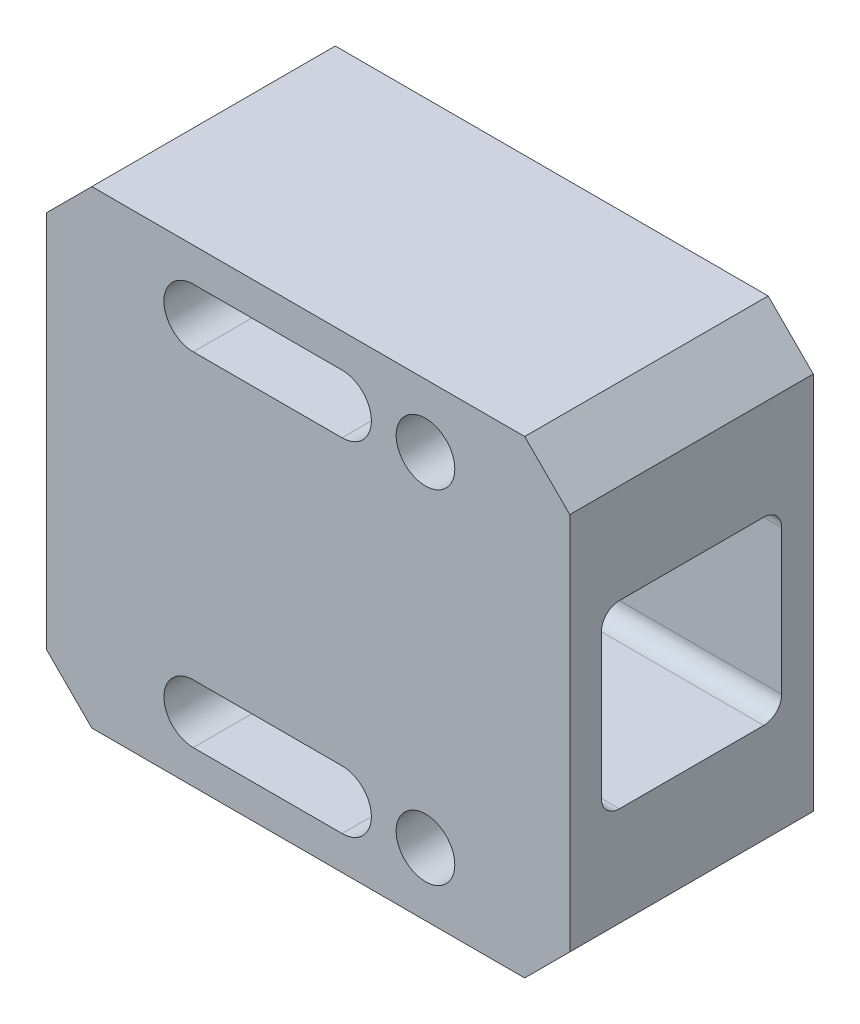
ISO-10303-21;
HEADER;
FILE_DESCRIPTION(('STEP AP214'),'2;1');
FILE_NAME('part.step','',(''),(''),'','','');
FILE_SCHEMA(('AUTOMOTIVE_DESIGN { 1 0 10303 214 1 1 1 1 }'));
ENDSEC;
DATA;
#1=APPLICATION_CONTEXT('core data for automotive mechanical design processes');
#2=APPLICATION_PROTOCOL_DEFINITION('international standard','automotive_design',2000,#1);
#3=PRODUCT_CONTEXT('',#1,'mechanical');
#4=PRODUCT('Part','Part','',(#3));
#5=PRODUCT_RELATED_PRODUCT_CATEGORY('part','',(#4));
#6=PRODUCT_DEFINITION_FORMATION('','',#4);
#7=PRODUCT_DEFINITION_CONTEXT('part definition',#1,'design');
#8=PRODUCT_DEFINITION('design','',#6,#7);
#9=PRODUCT_DEFINITION_SHAPE('','',#8);
#10=(LENGTH_UNIT() NAMED_UNIT(*) SI_UNIT(.MILLI.,.METRE.));
#11=(NAMED_UNIT(*) PLANE_ANGLE_UNIT() SI_UNIT($,.RADIAN.));
#12=(NAMED_UNIT(*) SI_UNIT($,.STERADIAN.) SOLID_ANGLE_UNIT());
#13=UNCERTAINTY_MEASURE_WITH_UNIT(LENGTH_MEASURE(1.E-05),#10,'distance_accuracy_value','');
#14=(GEOMETRIC_REPRESENTATION_CONTEXT(3) GLOBAL_UNCERTAINTY_ASSIGNED_CONTEXT((#13)) GLOBAL_UNIT_ASSIGNED_CONTEXT((#10,
#11,#12)) REPRESENTATION_CONTEXT('',''));
#15=CARTESIAN_POINT('',(0.,0.,0.));
#16=DIRECTION('',(0.,0.,1.));
#17=DIRECTION('',(1.,0.,0.));
#18=AXIS2_PLACEMENT_3D('',#15,#16,#17);
#19=CARTESIAN_POINT('',(-22.25,19.,13.5));
#20=DIRECTION('',(1.,0.,0.));
#21=DIRECTION('',(0.,1.,0.));
#22=AXIS2_PLACEMENT_3D('',#19,#20,#21);
#23=CYLINDRICAL_SURFACE('',#22,7.);
#24=CARTESIAN_POINT('',(-16.25,19.,13.5));
#25=DIRECTION('',(1.,0.,0.));
#26=DIRECTION('',(0.,1.,0.));
#27=AXIS2_PLACEMENT_3D('',#24,#25,#26);
#28=CIRCLE('',#27,7.);
#29=CARTESIAN_POINT('',(-16.25,26.,13.5));
#30=VERTEX_POINT('',#29);
#31=EDGE_CURVE('E9',#30,#30,#28,.F.);
#32=ORIENTED_EDGE('',*,*,#31,.T.);
#33=EDGE_LOOP('',(#32));
#34=FACE_BOUND('',#33,.T.);
#35=CARTESIAN_POINT('',(-21.25,19.,13.5));
#36=DIRECTION('',(-1.,0.,0.));
#37=DIRECTION('',(0.,0.,1.));
#38=AXIS2_PLACEMENT_3D('',#35,#36,#37);
#39=CIRCLE('',#38,7.);
#40=CARTESIAN_POINT('',(-21.25,19.,20.5));
#41=VERTEX_POINT('',#40);
#42=EDGE_CURVE('E249',#41,#41,#39,.T.);
#43=ORIENTED_EDGE('',*,*,#42,.F.);
#44=EDGE_LOOP('',(#43));
#45=FACE_BOUND('',#44,.T.);
#46=ADVANCED_FACE('F14',(#34,#45),#23,.T.);
#47=CARTESIAN_POINT('',(-16.25,45.,27.));
#48=DIRECTION('',(1.,0.,0.));
#49=DIRECTION('',(0.,1.,0.));
#50=AXIS2_PLACEMENT_3D('',#47,#48,#49);
#51=PLANE('',#50);
#52=DIRECTION('',(0.,-1.,0.));
#53=VECTOR('',#52,1.);
#54=CARTESIAN_POINT('',(-16.25,45.,27.));
#55=LINE('',#54,#53);
#56=CARTESIAN_POINT('',(-16.25,40.,27.));
#57=VERTEX_POINT('',#56);
#58=CARTESIAN_POINT('',(-16.25,-2.00000000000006,27.));
#59=VERTEX_POINT('',#58);
#60=EDGE_CURVE('E326',#57,#59,#55,.T.);
#61=ORIENTED_EDGE('',*,*,#60,.F.);
#62=DIRECTION('',(0.,0.,-1.));
#63=VECTOR('',#62,1.);
#64=CARTESIAN_POINT('',(-16.25,40.,27.));
#65=LINE('',#64,#63);
#66=CARTESIAN_POINT('',(-16.25,40.,0.));
#67=VERTEX_POINT('',#66);
#68=EDGE_CURVE('E374',#57,#67,#65,.T.);
#69=ORIENTED_EDGE('',*,*,#68,.T.);
#70=DIRECTION('',(0.,-1.,0.));
#71=VECTOR('',#70,1.);
#72=CARTESIAN_POINT('',(-16.25,45.,0.));
#73=LINE('',#72,#71);
#74=CARTESIAN_POINT('',(-16.25,-2.00000000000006,0.));
#75=VERTEX_POINT('',#74);
#76=EDGE_CURVE('E339',#67,#75,#73,.T.);
#77=ORIENTED_EDGE('',*,*,#76,.T.);
#78=DIRECTION('',(0.,0.,1.));
#79=VECTOR('',#78,1.);
#80=CARTESIAN_POINT('',(-16.25,-2.00000000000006,27.));
#81=LINE('',#80,#79);
#82=EDGE_CURVE('E372',#75,#59,#81,.T.);
#83=ORIENTED_EDGE('',*,*,#82,.T.);
#84=EDGE_LOOP('',(#61,#69,#77,#83));
#85=FACE_BOUND('',#84,.T.);
#86=ORIENTED_EDGE('',*,*,#31,.F.);
#87=EDGE_LOOP('',(#86));
#88=FACE_BOUND('',#87,.T.);
#89=ADVANCED_FACE('F414',(#85,#88),#51,.F.);
#90=CARTESIAN_POINT('',(-16.25,45.,27.));
#91=DIRECTION('',(0.,0.,1.));
#92=DIRECTION('',(-1.,0.,0.));
#93=AXIS2_PLACEMENT_3D('',#90,#91,#92);
#94=PLANE('',#93);
#95=CARTESIAN_POINT('',(16.5,38.,27.));
#96=DIRECTION('',(0.,0.,1.));
#97=DIRECTION('',(1.,0.,0.));
#98=AXIS2_PLACEMENT_3D('',#95,#96,#97);
#99=CIRCLE('',#98,3.25);
#100=CARTESIAN_POINT('',(16.5,34.75,27.));
#101=VERTEX_POINT('',#100);
#102=CARTESIAN_POINT('',(16.5,41.25,27.));
#103=VERTEX_POINT('',#102);
#104=EDGE_CURVE('E29',#101,#103,#99,.T.);
#105=ORIENTED_EDGE('',*,*,#104,.F.);
#106=DIRECTION('',(1.,0.,0.));
#107=VECTOR('',#106,1.);
#108=CARTESIAN_POINT('',(0.,34.75,27.));
#109=LINE('',#108,#107);
#110=CARTESIAN_POINT('',(0.,34.75,27.));
#111=VERTEX_POINT('',#110);
#112=EDGE_CURVE('E193',#111,#101,#109,.T.);
#113=ORIENTED_EDGE('',*,*,#112,.F.);
#114=CARTESIAN_POINT('',(0.,38.,27.));
#115=DIRECTION('',(0.,0.,1.));
#116=DIRECTION('',(1.,0.,0.));
#117=AXIS2_PLACEMENT_3D('',#114,#115,#116);
#118=CIRCLE('',#117,3.25);
#119=CARTESIAN_POINT('',(0.,41.25,27.));
#120=VERTEX_POINT('',#119);
#121=EDGE_CURVE('E196',#120,#111,#118,.T.);
#122=ORIENTED_EDGE('',*,*,#121,.F.);
#123=DIRECTION('',(-1.,0.,0.));
#124=VECTOR('',#123,1.);
#125=CARTESIAN_POINT('',(16.5,41.25,27.));
#126=LINE('',#125,#124);
#127=EDGE_CURVE('E202',#103,#120,#126,.T.);
#128=ORIENTED_EDGE('',*,*,#127,.F.);
#129=EDGE_LOOP('',(#105,#113,#122,#128));
#130=FACE_BOUND('',#129,.T.);
#131=CARTESIAN_POINT('',(25.75,38.,27.));
#132=DIRECTION('',(0.,0.,1.));
#133=DIRECTION('',(1.,0.,0.));
#134=AXIS2_PLACEMENT_3D('',#131,#132,#133);
#135=CIRCLE('',#134,3.25);
#136=CARTESIAN_POINT('',(29.,38.,27.));
#137=VERTEX_POINT('',#136);
#138=EDGE_CURVE('E208',#137,#137,#135,.T.);
#139=ORIENTED_EDGE('',*,*,#138,.F.);
#140=EDGE_LOOP('',(#139));
#141=FACE_BOUND('',#140,.T.);
#142=CARTESIAN_POINT('',(25.75,0.,27.));
#143=DIRECTION('',(0.,0.,1.));
#144=DIRECTION('',(1.,0.,0.));
#145=AXIS2_PLACEMENT_3D('',#142,#143,#144);
#146=CIRCLE('',#145,3.25);
#147=CARTESIAN_POINT('',(29.,0.,27.));
#148=VERTEX_POINT('',#147);
#149=EDGE_CURVE('E215',#148,#148,#146,.T.);
#150=ORIENTED_EDGE('',*,*,#149,.F.);
#151=EDGE_LOOP('',(#150));
#152=FACE_BOUND('',#151,.T.);
#153=CARTESIAN_POINT('',(16.5,0.,27.));
#154=DIRECTION('',(0.,0.,1.));
#155=DIRECTION('',(1.,0.,0.));
#156=AXIS2_PLACEMENT_3D('',#153,#154,#155);
#157=CIRCLE('',#156,3.25);
#158=CARTESIAN_POINT('',(16.5,-3.25000000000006,27.));
#159=VERTEX_POINT('',#158);
#160=CARTESIAN_POINT('',(16.5,3.25,27.));
#161=VERTEX_POINT('',#160);
#162=EDGE_CURVE('E221',#159,#161,#157,.T.);
#163=ORIENTED_EDGE('',*,*,#162,.F.);
#164=DIRECTION('',(1.,0.,0.));
#165=VECTOR('',#164,1.);
#166=CARTESIAN_POINT('',(0.,-3.25000000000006,27.));
#167=LINE('',#166,#165);
#168=CARTESIAN_POINT('',(0.,-3.25,27.));
#169=VERTEX_POINT('',#168);
#170=EDGE_CURVE('E228',#169,#159,#167,.T.);
#171=ORIENTED_EDGE('',*,*,#170,.F.);
#172=CARTESIAN_POINT('',(0.,0.,27.));
#173=DIRECTION('',(0.,0.,1.));
#174=DIRECTION('',(1.,0.,0.));
#175=AXIS2_PLACEMENT_3D('',#172,#173,#174);
#176=CIRCLE('',#175,3.25);
#177=CARTESIAN_POINT('',(0.,3.25,27.));
#178=VERTEX_POINT('',#177);
#179=EDGE_CURVE('E242',#178,#169,#176,.T.);
#180=ORIENTED_EDGE('',*,*,#179,.F.);
#181=DIRECTION('',(-1.,0.,0.));
#182=VECTOR('',#181,1.);
#183=CARTESIAN_POINT('',(16.5,3.25,27.));
#184=LINE('',#183,#182);
#185=EDGE_CURVE('E239',#161,#178,#184,.T.);
#186=ORIENTED_EDGE('',*,*,#185,.F.);
#187=EDGE_LOOP('',(#163,#171,#180,#186));
#188=FACE_BOUND('',#187,.T.);
#189=DIRECTION('',(0.,1.,0.));
#190=VECTOR('',#189,1.);
#191=CARTESIAN_POINT('',(41.75,45.,27.));
#192=LINE('',#191,#190);
#193=CARTESIAN_POINT('',(41.75,-2.00000000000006,27.));
#194=VERTEX_POINT('',#193);
#195=CARTESIAN_POINT('',(41.75,40.,27.));
#196=VERTEX_POINT('',#195);
#197=EDGE_CURVE('E333',#194,#196,#192,.T.);
#198=ORIENTED_EDGE('',*,*,#197,.T.);
#199=DIRECTION('',(0.707106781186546,-0.707106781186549,0.));
#200=VECTOR('',#199,1.);
#201=CARTESIAN_POINT('',(10.2500000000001,71.5,27.));
#202=LINE('',#201,#200);
#203=CARTESIAN_POINT('',(36.75,45.,27.));
#204=VERTEX_POINT('',#203);
#205=EDGE_CURVE('E370',#196,#204,#202,.F.);
#206=ORIENTED_EDGE('',*,*,#205,.T.);
#207=DIRECTION('',(-1.,0.,0.));
#208=VECTOR('',#207,1.);
#209=CARTESIAN_POINT('',(41.75,45.,27.));
#210=LINE('',#209,#208);
#211=CARTESIAN_POINT('',(-11.25,45.,27.));
#212=VERTEX_POINT('',#211);
#213=EDGE_CURVE('E323',#204,#212,#210,.T.);
#214=ORIENTED_EDGE('',*,*,#213,.T.);
#215=DIRECTION('',(0.707106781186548,0.707106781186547,0.));
#216=VECTOR('',#215,1.);
#217=CARTESIAN_POINT('',(-13.75,42.5,27.));
#218=LINE('',#217,#216);
#219=EDGE_CURVE('E368',#212,#57,#218,.F.);
#220=ORIENTED_EDGE('',*,*,#219,.T.);
#221=ORIENTED_EDGE('',*,*,#60,.T.);
#222=DIRECTION('',(-0.707106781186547,0.707106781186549,0.));
#223=VECTOR('',#222,1.);
#224=CARTESIAN_POINT('',(-39.75,21.5,27.));
#225=LINE('',#224,#223);
#226=CARTESIAN_POINT('',(-11.25,-7.,27.));
#227=VERTEX_POINT('',#226);
#228=EDGE_CURVE('E366',#59,#227,#225,.F.);
#229=ORIENTED_EDGE('',*,*,#228,.T.);
#230=DIRECTION('',(1.,0.,0.));
#231=VECTOR('',#230,1.);
#232=CARTESIAN_POINT('',(41.75,-7.,27.));
#233=LINE('',#232,#231);
#234=CARTESIAN_POINT('',(36.75,-7.,27.));
#235=VERTEX_POINT('',#234);
#236=EDGE_CURVE('E330',#227,#235,#233,.T.);
#237=ORIENTED_EDGE('',*,*,#236,.T.);
#238=DIRECTION('',(-0.707106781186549,-0.707106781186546,0.));
#239=VECTOR('',#238,1.);
#240=CARTESIAN_POINT('',(36.25,-7.5,27.));
#241=LINE('',#240,#239);
#242=EDGE_CURVE('E364',#235,#194,#241,.F.);
#243=ORIENTED_EDGE('',*,*,#242,.T.);
#244=EDGE_LOOP('',(#198,#206,#214,#220,#221,#229,#237,#243));
#245=FACE_BOUND('',#244,.T.);
#246=ADVANCED_FACE('F400',(#130,#141,#152,#188,#245),#94,.T.);
#247=CARTESIAN_POINT('',(-16.25,45.,0.));
#248=DIRECTION('',(0.,0.,1.));
#249=DIRECTION('',(-1.,0.,0.));
#250=AXIS2_PLACEMENT_3D('',#247,#248,#249);
#251=PLANE('',#250);
#252=DIRECTION('',(1.,0.,0.));
#253=VECTOR('',#252,1.);
#254=CARTESIAN_POINT('',(0.,34.75,0.));
#255=LINE('',#254,#253);
#256=CARTESIAN_POINT('',(0.,34.75,0.));
#257=VERTEX_POINT('',#256);
#258=CARTESIAN_POINT('',(16.5,34.75,0.));
#259=VERTEX_POINT('',#258);
#260=EDGE_CURVE('E183',#257,#259,#255,.T.);
#261=ORIENTED_EDGE('',*,*,#260,.T.);
#262=CARTESIAN_POINT('',(16.5,38.,0.));
#263=DIRECTION('',(0.,0.,1.));
#264=DIRECTION('',(1.,0.,0.));
#265=AXIS2_PLACEMENT_3D('',#262,#263,#264);
#266=CIRCLE('',#265,3.25);
#267=CARTESIAN_POINT('',(16.5,41.25,0.));
#268=VERTEX_POINT('',#267);
#269=EDGE_CURVE('E177',#259,#268,#266,.T.);
#270=ORIENTED_EDGE('',*,*,#269,.T.);
#271=DIRECTION('',(-1.,0.,0.));
#272=VECTOR('',#271,1.);
#273=CARTESIAN_POINT('',(16.5,41.25,0.));
#274=LINE('',#273,#272);
#275=CARTESIAN_POINT('',(0.,41.25,0.));
#276=VERTEX_POINT('',#275);
#277=EDGE_CURVE('E186',#268,#276,#274,.T.);
#278=ORIENTED_EDGE('',*,*,#277,.T.);
#279=CARTESIAN_POINT('',(0.,38.,0.));
#280=DIRECTION('',(0.,0.,1.));
#281=DIRECTION('',(1.,0.,0.));
#282=AXIS2_PLACEMENT_3D('',#279,#280,#281);
#283=CIRCLE('',#282,3.25);
#284=EDGE_CURVE('E37',#276,#257,#283,.T.);
#285=ORIENTED_EDGE('',*,*,#284,.T.);
#286=EDGE_LOOP('',(#261,#270,#278,#285));
#287=FACE_BOUND('',#286,.T.);
#288=CARTESIAN_POINT('',(25.75,38.,0.));
#289=DIRECTION('',(0.,0.,1.));
#290=DIRECTION('',(1.,0.,0.));
#291=AXIS2_PLACEMENT_3D('',#288,#289,#290);
#292=CIRCLE('',#291,3.25);
#293=CARTESIAN_POINT('',(29.,38.,0.));
#294=VERTEX_POINT('',#293);
#295=EDGE_CURVE('E212',#294,#294,#292,.T.);
#296=ORIENTED_EDGE('',*,*,#295,.T.);
#297=EDGE_LOOP('',(#296));
#298=FACE_BOUND('',#297,.T.);
#299=CARTESIAN_POINT('',(25.75,0.,0.));
#300=DIRECTION('',(0.,0.,1.));
#301=DIRECTION('',(1.,0.,0.));
#302=AXIS2_PLACEMENT_3D('',#299,#300,#301);
#303=CIRCLE('',#302,3.25);
#304=CARTESIAN_POINT('',(29.,0.,0.));
#305=VERTEX_POINT('',#304);
#306=EDGE_CURVE('E218',#305,#305,#303,.T.);
#307=ORIENTED_EDGE('',*,*,#306,.T.);
#308=EDGE_LOOP('',(#307));
#309=FACE_BOUND('',#308,.T.);
#310=DIRECTION('',(1.,0.,0.));
#311=VECTOR('',#310,1.);
#312=CARTESIAN_POINT('',(0.,-3.25000000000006,0.));
#313=LINE('',#312,#311);
#314=CARTESIAN_POINT('',(0.,-3.25,0.));
#315=VERTEX_POINT('',#314);
#316=CARTESIAN_POINT('',(16.5,-3.25000000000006,0.));
#317=VERTEX_POINT('',#316);
#318=EDGE_CURVE('E234',#315,#317,#313,.T.);
#319=ORIENTED_EDGE('',*,*,#318,.T.);
#320=CARTESIAN_POINT('',(16.5,0.,0.));
#321=DIRECTION('',(0.,0.,1.));
#322=DIRECTION('',(1.,0.,0.));
#323=AXIS2_PLACEMENT_3D('',#320,#321,#322);
#324=CIRCLE('',#323,3.25);
#325=CARTESIAN_POINT('',(16.5,3.25,0.));
#326=VERTEX_POINT('',#325);
#327=EDGE_CURVE('E224',#317,#326,#324,.T.);
#328=ORIENTED_EDGE('',*,*,#327,.T.);
#329=DIRECTION('',(-1.,0.,0.));
#330=VECTOR('',#329,1.);
#331=CARTESIAN_POINT('',(16.5,3.25,0.));
#332=LINE('',#331,#330);
#333=CARTESIAN_POINT('',(0.,3.25,0.));
#334=VERTEX_POINT('',#333);
#335=EDGE_CURVE('E227',#326,#334,#332,.T.);
#336=ORIENTED_EDGE('',*,*,#335,.T.);
#337=CARTESIAN_POINT('',(0.,0.,0.));
#338=DIRECTION('',(0.,0.,1.));
#339=DIRECTION('',(1.,0.,0.));
#340=AXIS2_PLACEMENT_3D('',#337,#338,#339);
#341=CIRCLE('',#340,3.25);
#342=EDGE_CURVE('E231',#334,#315,#341,.T.);
#343=ORIENTED_EDGE('',*,*,#342,.T.);
#344=EDGE_LOOP('',(#319,#328,#336,#343));
#345=FACE_BOUND('',#344,.T.);
#346=DIRECTION('',(-1.,0.,0.));
#347=VECTOR('',#346,1.);
#348=CARTESIAN_POINT('',(41.75,45.,0.));
#349=LINE('',#348,#347);
#350=CARTESIAN_POINT('',(36.75,45.,0.));
#351=VERTEX_POINT('',#350);
#352=CARTESIAN_POINT('',(-11.25,45.,0.));
#353=VERTEX_POINT('',#352);
#354=EDGE_CURVE('E308',#351,#353,#349,.T.);
#355=ORIENTED_EDGE('',*,*,#354,.F.);
#356=DIRECTION('',(-0.707106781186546,0.707106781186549,0.));
#357=VECTOR('',#356,1.);
#358=CARTESIAN_POINT('',(36.75,45.,0.));
#359=LINE('',#358,#357);
#360=CARTESIAN_POINT('',(41.75,40.,0.));
#361=VERTEX_POINT('',#360);
#362=EDGE_CURVE('E357',#351,#361,#359,.F.);
#363=ORIENTED_EDGE('',*,*,#362,.T.);
#364=DIRECTION('',(0.,1.,0.));
#365=VECTOR('',#364,1.);
#366=CARTESIAN_POINT('',(41.75,45.,0.));
#367=LINE('',#366,#365);
#368=CARTESIAN_POINT('',(41.75,-2.00000000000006,0.));
#369=VERTEX_POINT('',#368);
#370=EDGE_CURVE('E327',#369,#361,#367,.T.);
#371=ORIENTED_EDGE('',*,*,#370,.F.);
#372=DIRECTION('',(0.707106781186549,0.707106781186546,0.));
#373=VECTOR('',#372,1.);
#374=CARTESIAN_POINT('',(41.75,-2.00000000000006,0.));
#375=LINE('',#374,#373);
#376=CARTESIAN_POINT('',(36.75,-7.,0.));
#377=VERTEX_POINT('',#376);
#378=EDGE_CURVE('E351',#369,#377,#375,.F.);
#379=ORIENTED_EDGE('',*,*,#378,.T.);
#380=DIRECTION('',(1.,0.,0.));
#381=VECTOR('',#380,1.);
#382=CARTESIAN_POINT('',(41.75,-7.,0.));
#383=LINE('',#382,#381);
#384=CARTESIAN_POINT('',(-11.25,-7.,0.));
#385=VERTEX_POINT('',#384);
#386=EDGE_CURVE('E342',#385,#377,#383,.T.);
#387=ORIENTED_EDGE('',*,*,#386,.F.);
#388=DIRECTION('',(0.707106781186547,-0.707106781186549,0.));
#389=VECTOR('',#388,1.);
#390=CARTESIAN_POINT('',(-11.25,-7.,0.));
#391=LINE('',#390,#389);
#392=EDGE_CURVE('E353',#385,#75,#391,.F.);
#393=ORIENTED_EDGE('',*,*,#392,.T.);
#394=ORIENTED_EDGE('',*,*,#76,.F.);
#395=DIRECTION('',(-0.707106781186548,-0.707106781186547,0.));
#396=VECTOR('',#395,1.);
#397=CARTESIAN_POINT('',(-16.25,40.,0.));
#398=LINE('',#397,#396);
#399=EDGE_CURVE('E355',#67,#353,#398,.F.);
#400=ORIENTED_EDGE('',*,*,#399,.T.);
#401=EDGE_LOOP('',(#355,#363,#371,#379,#387,#393,#394,#400));
#402=FACE_BOUND('',#401,.T.);
#403=ADVANCED_FACE('F190',(#287,#298,#309,#345,#402),#251,.F.);
#404=CARTESIAN_POINT('',(41.75,45.,27.));
#405=DIRECTION('',(0.,-1.,0.));
#406=DIRECTION('',(1.,0.,0.));
#407=AXIS2_PLACEMENT_3D('',#404,#405,#406);
#408=PLANE('',#407);
#409=ORIENTED_EDGE('',*,*,#213,.F.);
#410=DIRECTION('',(0.,0.,-1.));
#411=VECTOR('',#410,1.);
#412=CARTESIAN_POINT('',(36.75,45.,27.));
#413=LINE('',#412,#411);
#414=EDGE_CURVE('E348',#204,#351,#413,.T.);
#415=ORIENTED_EDGE('',*,*,#414,.T.);
#416=ORIENTED_EDGE('',*,*,#354,.T.);
#417=DIRECTION('',(0.,0.,1.));
#418=VECTOR('',#417,1.);
#419=CARTESIAN_POINT('',(-11.25,45.,27.));
#420=LINE('',#419,#418);
#421=EDGE_CURVE('E336',#353,#212,#420,.T.);
#422=ORIENTED_EDGE('',*,*,#421,.T.);
#423=EDGE_LOOP('',(#409,#415,#416,#422));
#424=FACE_BOUND('',#423,.T.);
#425=ADVANCED_FACE('F406',(#424),#408,.F.);
#426=CARTESIAN_POINT('',(41.75,-7.,27.));
#427=DIRECTION('',(0.,1.,0.));
#428=DIRECTION('',(-1.,0.,0.));
#429=AXIS2_PLACEMENT_3D('',#426,#427,#428);
#430=PLANE('',#429);
#431=ORIENTED_EDGE('',*,*,#236,.F.);
#432=DIRECTION('',(0.,0.,-1.));
#433=VECTOR('',#432,1.);
#434=CARTESIAN_POINT('',(-11.25,-7.,27.));
#435=LINE('',#434,#433);
#436=EDGE_CURVE('E22',#227,#385,#435,.T.);
#437=ORIENTED_EDGE('',*,*,#436,.T.);
#438=ORIENTED_EDGE('',*,*,#386,.T.);
#439=DIRECTION('',(0.,0.,1.));
#440=VECTOR('',#439,1.);
#441=CARTESIAN_POINT('',(36.75,-7.,27.));
#442=LINE('',#441,#440);
#443=EDGE_CURVE('E377',#377,#235,#442,.T.);
#444=ORIENTED_EDGE('',*,*,#443,.T.);
#445=EDGE_LOOP('',(#431,#437,#438,#444));
#446=FACE_BOUND('',#445,.T.);
#447=ADVANCED_FACE('F383',(#446),#430,.F.);
#448=CARTESIAN_POINT('',(41.75,45.,27.));
#449=DIRECTION('',(-1.,0.,0.));
#450=DIRECTION('',(0.,-1.,0.));
#451=AXIS2_PLACEMENT_3D('',#448,#449,#450);
#452=PLANE('',#451);
#453=DIRECTION('',(0.,0.,1.));
#454=VECTOR('',#453,1.);
#455=CARTESIAN_POINT('',(41.75,29.,5.5));
#456=LINE('',#455,#454);
#457=CARTESIAN_POINT('',(41.75,29.,5.5));
#458=VERTEX_POINT('',#457);
#459=CARTESIAN_POINT('',(41.75,29.,21.5));
#460=VERTEX_POINT('',#459);
#461=EDGE_CURVE('E284',#458,#460,#456,.T.);
#462=ORIENTED_EDGE('',*,*,#461,.F.);
#463=CARTESIAN_POINT('',(41.75,27.,5.5));
#464=DIRECTION('',(1.,0.,0.));
#465=DIRECTION('',(0.,-1.,0.));
#466=AXIS2_PLACEMENT_3D('',#463,#464,#465);
#467=CIRCLE('',#466,2.);
#468=CARTESIAN_POINT('',(41.75,27.,3.5));
#469=VERTEX_POINT('',#468);
#470=EDGE_CURVE('E282',#469,#458,#467,.T.);
#471=ORIENTED_EDGE('',*,*,#470,.F.);
#472=DIRECTION('',(0.,1.,0.));
#473=VECTOR('',#472,1.);
#474=CARTESIAN_POINT('',(41.75,27.,3.5));
#475=LINE('',#474,#473);
#476=CARTESIAN_POINT('',(41.75,11.,3.5));
#477=VERTEX_POINT('',#476);
#478=EDGE_CURVE('E302',#477,#469,#475,.T.);
#479=ORIENTED_EDGE('',*,*,#478,.F.);
#480=CARTESIAN_POINT('',(41.75,11.,5.5));
#481=DIRECTION('',(1.,0.,0.));
#482=DIRECTION('',(0.,-1.,0.));
#483=AXIS2_PLACEMENT_3D('',#480,#481,#482);
#484=CIRCLE('',#483,2.);
#485=CARTESIAN_POINT('',(41.75,9.,5.5));
#486=VERTEX_POINT('',#485);
#487=EDGE_CURVE('E299',#486,#477,#484,.T.);
#488=ORIENTED_EDGE('',*,*,#487,.F.);
#489=DIRECTION('',(0.,0.,-1.));
#490=VECTOR('',#489,1.);
#491=CARTESIAN_POINT('',(41.75,9.,5.5));
#492=LINE('',#491,#490);
#493=CARTESIAN_POINT('',(41.75,9.,21.5));
#494=VERTEX_POINT('',#493);
#495=EDGE_CURVE('E296',#494,#486,#492,.T.);
#496=ORIENTED_EDGE('',*,*,#495,.F.);
#497=CARTESIAN_POINT('',(41.75,11.,21.5));
#498=DIRECTION('',(1.,0.,0.));
#499=DIRECTION('',(0.,-1.,0.));
#500=AXIS2_PLACEMENT_3D('',#497,#498,#499);
#501=CIRCLE('',#500,2.);
#502=CARTESIAN_POINT('',(41.75,11.,23.5));
#503=VERTEX_POINT('',#502);
#504=EDGE_CURVE('E293',#503,#494,#501,.T.);
#505=ORIENTED_EDGE('',*,*,#504,.F.);
#506=DIRECTION('',(0.,-1.,0.));
#507=VECTOR('',#506,1.);
#508=CARTESIAN_POINT('',(41.75,27.,23.5));
#509=LINE('',#508,#507);
#510=CARTESIAN_POINT('',(41.75,27.,23.5));
#511=VERTEX_POINT('',#510);
#512=EDGE_CURVE('E290',#511,#503,#509,.T.);
#513=ORIENTED_EDGE('',*,*,#512,.F.);
#514=CARTESIAN_POINT('',(41.75,27.,21.5));
#515=DIRECTION('',(1.,0.,0.));
#516=DIRECTION('',(0.,-1.,0.));
#517=AXIS2_PLACEMENT_3D('',#514,#515,#516);
#518=CIRCLE('',#517,2.);
#519=EDGE_CURVE('E287',#460,#511,#518,.T.);
#520=ORIENTED_EDGE('',*,*,#519,.F.);
#521=EDGE_LOOP('',(#462,#471,#479,#488,#496,#505,#513,#520));
#522=FACE_BOUND('',#521,.T.);
#523=ORIENTED_EDGE('',*,*,#370,.T.);
#524=DIRECTION('',(0.,0.,1.));
#525=VECTOR('',#524,1.);
#526=CARTESIAN_POINT('',(41.75,40.,27.));
#527=LINE('',#526,#525);
#528=EDGE_CURVE('E362',#361,#196,#527,.T.);
#529=ORIENTED_EDGE('',*,*,#528,.T.);
#530=ORIENTED_EDGE('',*,*,#197,.F.);
#531=DIRECTION('',(0.,0.,-1.));
#532=VECTOR('',#531,1.);
#533=CARTESIAN_POINT('',(41.75,-2.00000000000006,27.));
#534=LINE('',#533,#532);
#535=EDGE_CURVE('E359',#194,#369,#534,.T.);
#536=ORIENTED_EDGE('',*,*,#535,.T.);
#537=EDGE_LOOP('',(#523,#529,#530,#536));
#538=FACE_BOUND('',#537,.T.);
#539=ADVANCED_FACE('F396',(#522,#538),#452,.F.);
#540=CARTESIAN_POINT('',(36.75,45.,27.));
#541=DIRECTION('',(-0.707106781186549,-0.707106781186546,0.));
#542=DIRECTION('',(0.707106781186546,-0.707106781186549,0.));
#543=AXIS2_PLACEMENT_3D('',#540,#541,#542);
#544=PLANE('',#543);
#545=ORIENTED_EDGE('',*,*,#205,.F.);
#546=ORIENTED_EDGE('',*,*,#528,.F.);
#547=ORIENTED_EDGE('',*,*,#362,.F.);
#548=ORIENTED_EDGE('',*,*,#414,.F.);
#549=EDGE_LOOP('',(#545,#546,#547,#548));
#550=FACE_BOUND('',#549,.T.);
#551=ADVANCED_FACE('F404',(#550),#544,.F.);
#552=CARTESIAN_POINT('',(-16.25,40.,27.));
#553=DIRECTION('',(0.707106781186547,-0.707106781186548,0.));
#554=DIRECTION('',(0.707106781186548,0.707106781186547,0.));
#555=AXIS2_PLACEMENT_3D('',#552,#553,#554);
#556=PLANE('',#555);
#557=ORIENTED_EDGE('',*,*,#219,.F.);
#558=ORIENTED_EDGE('',*,*,#421,.F.);
#559=ORIENTED_EDGE('',*,*,#399,.F.);
#560=ORIENTED_EDGE('',*,*,#68,.F.);
#561=EDGE_LOOP('',(#557,#558,#559,#560));
#562=FACE_BOUND('',#561,.T.);
#563=ADVANCED_FACE('F411',(#562),#556,.F.);
#564=CARTESIAN_POINT('',(-11.25,-7.,27.));
#565=DIRECTION('',(0.707106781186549,0.707106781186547,0.));
#566=DIRECTION('',(-0.707106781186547,0.707106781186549,0.));
#567=AXIS2_PLACEMENT_3D('',#564,#565,#566);
#568=PLANE('',#567);
#569=ORIENTED_EDGE('',*,*,#228,.F.);
#570=ORIENTED_EDGE('',*,*,#82,.F.);
#571=ORIENTED_EDGE('',*,*,#392,.F.);
#572=ORIENTED_EDGE('',*,*,#436,.F.);
#573=EDGE_LOOP('',(#569,#570,#571,#572));
#574=FACE_BOUND('',#573,.T.);
#575=ADVANCED_FACE('F417',(#574),#568,.F.);
#576=CARTESIAN_POINT('',(41.75,-2.00000000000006,27.));
#577=DIRECTION('',(-0.707106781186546,0.707106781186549,0.));
#578=DIRECTION('',(-0.707106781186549,-0.707106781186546,0.));
#579=AXIS2_PLACEMENT_3D('',#576,#577,#578);
#580=PLANE('',#579);
#581=ORIENTED_EDGE('',*,*,#242,.F.);
#582=ORIENTED_EDGE('',*,*,#443,.F.);
#583=ORIENTED_EDGE('',*,*,#378,.F.);
#584=ORIENTED_EDGE('',*,*,#535,.F.);
#585=EDGE_LOOP('',(#581,#582,#583,#584));
#586=FACE_BOUND('',#585,.T.);
#587=ADVANCED_FACE('F16',(#586),#580,.F.);
#588=CARTESIAN_POINT('',(1.75,27.,5.5));
#589=DIRECTION('',(1.,0.,0.));
#590=DIRECTION('',(0.,1.,0.));
#591=AXIS2_PLACEMENT_3D('',#588,#589,#590);
#592=CYLINDRICAL_SURFACE('',#591,2.);
#593=ORIENTED_EDGE('',*,*,#470,.T.);
#594=DIRECTION('',(1.,0.,0.));
#595=VECTOR('',#594,1.);
#596=CARTESIAN_POINT('',(1.75,29.,5.5));
#597=LINE('',#596,#595);
#598=CARTESIAN_POINT('',(-3.25,29.,5.5));
#599=VERTEX_POINT('',#598);
#600=EDGE_CURVE('E305',#599,#458,#597,.T.);
#601=ORIENTED_EDGE('',*,*,#600,.F.);
#602=CARTESIAN_POINT('',(-3.25,27.,5.5));
#603=DIRECTION('',(1.,0.,0.));
#604=DIRECTION('',(0.,1.,0.));
#605=AXIS2_PLACEMENT_3D('',#602,#603,#604);
#606=CIRCLE('',#605,2.);
#607=CARTESIAN_POINT('',(-3.25,27.,3.5));
#608=VERTEX_POINT('',#607);
#609=EDGE_CURVE('E258',#608,#599,#606,.T.);
#610=ORIENTED_EDGE('',*,*,#609,.F.);
#611=DIRECTION('',(1.,0.,0.));
#612=VECTOR('',#611,1.);
#613=CARTESIAN_POINT('',(1.75,27.,3.5));
#614=LINE('',#613,#612);
#615=EDGE_CURVE('E306',#608,#469,#614,.T.);
#616=ORIENTED_EDGE('',*,*,#615,.T.);
#617=EDGE_LOOP('',(#593,#601,#610,#616));
#618=FACE_BOUND('',#617,.T.);
#619=ADVANCED_FACE('F425',(#618),#592,.F.);
#620=CARTESIAN_POINT('',(1.75,27.,3.5));
#621=DIRECTION('',(0.,0.,-1.));
#622=DIRECTION('',(0.,-1.,0.));
#623=AXIS2_PLACEMENT_3D('',#620,#621,#622);
#624=PLANE('',#623);
#625=ORIENTED_EDGE('',*,*,#478,.T.);
#626=ORIENTED_EDGE('',*,*,#615,.F.);
#627=DIRECTION('',(0.,1.,0.));
#628=VECTOR('',#627,1.);
#629=CARTESIAN_POINT('',(-3.25,11.,3.5));
#630=LINE('',#629,#628);
#631=CARTESIAN_POINT('',(-3.25,11.,3.5));
#632=VERTEX_POINT('',#631);
#633=EDGE_CURVE('E279',#632,#608,#630,.T.);
#634=ORIENTED_EDGE('',*,*,#633,.F.);
#635=DIRECTION('',(1.,0.,0.));
#636=VECTOR('',#635,1.);
#637=CARTESIAN_POINT('',(1.75,11.,3.5));
#638=LINE('',#637,#636);
#639=EDGE_CURVE('E309',#632,#477,#638,.T.);
#640=ORIENTED_EDGE('',*,*,#639,.T.);
#641=EDGE_LOOP('',(#625,#626,#634,#640));
#642=FACE_BOUND('',#641,.T.);
#643=ADVANCED_FACE('F525',(#642),#624,.F.);
#644=CARTESIAN_POINT('',(1.75,11.,5.5));
#645=DIRECTION('',(1.,0.,0.));
#646=DIRECTION('',(0.,1.,0.));
#647=AXIS2_PLACEMENT_3D('',#644,#645,#646);
#648=CYLINDRICAL_SURFACE('',#647,2.);
#649=ORIENTED_EDGE('',*,*,#487,.T.);
#650=ORIENTED_EDGE('',*,*,#639,.F.);
#651=CARTESIAN_POINT('',(-3.25,11.,5.5));
#652=DIRECTION('',(1.,0.,0.));
#653=DIRECTION('',(0.,1.,0.));
#654=AXIS2_PLACEMENT_3D('',#651,#652,#653);
#655=CIRCLE('',#654,2.);
#656=CARTESIAN_POINT('',(-3.25,9.,5.5));
#657=VERTEX_POINT('',#656);
#658=EDGE_CURVE('E276',#657,#632,#655,.T.);
#659=ORIENTED_EDGE('',*,*,#658,.F.);
#660=DIRECTION('',(1.,0.,0.));
#661=VECTOR('',#660,1.);
#662=CARTESIAN_POINT('',(1.75,9.,5.5));
#663=LINE('',#662,#661);
#664=EDGE_CURVE('E311',#657,#486,#663,.T.);
#665=ORIENTED_EDGE('',*,*,#664,.T.);
#666=EDGE_LOOP('',(#649,#650,#659,#665));
#667=FACE_BOUND('',#666,.T.);
#668=ADVANCED_FACE('F532',(#667),#648,.F.);
#669=CARTESIAN_POINT('',(1.75,9.,5.5));
#670=DIRECTION('',(0.,-1.,0.));
#671=DIRECTION('',(0.,0.,1.));
#672=AXIS2_PLACEMENT_3D('',#669,#670,#671);
#673=PLANE('',#672);
#674=ORIENTED_EDGE('',*,*,#495,.T.);
#675=ORIENTED_EDGE('',*,*,#664,.F.);
#676=DIRECTION('',(0.,0.,-1.));
#677=VECTOR('',#676,1.);
#678=CARTESIAN_POINT('',(-3.25,9.,21.5));
#679=LINE('',#678,#677);
#680=CARTESIAN_POINT('',(-3.25,9.,21.5));
#681=VERTEX_POINT('',#680);
#682=EDGE_CURVE('E273',#681,#657,#679,.T.);
#683=ORIENTED_EDGE('',*,*,#682,.F.);
#684=DIRECTION('',(1.,0.,0.));
#685=VECTOR('',#684,1.);
#686=CARTESIAN_POINT('',(1.75,9.,21.5));
#687=LINE('',#686,#685);
#688=EDGE_CURVE('E313',#681,#494,#687,.T.);
#689=ORIENTED_EDGE('',*,*,#688,.T.);
#690=EDGE_LOOP('',(#674,#675,#683,#689));
#691=FACE_BOUND('',#690,.T.);
#692=ADVANCED_FACE('F541',(#691),#673,.F.);
#693=CARTESIAN_POINT('',(1.75,11.,21.5));
#694=DIRECTION('',(1.,0.,0.));
#695=DIRECTION('',(0.,1.,0.));
#696=AXIS2_PLACEMENT_3D('',#693,#694,#695);
#697=CYLINDRICAL_SURFACE('',#696,2.);
#698=ORIENTED_EDGE('',*,*,#504,.T.);
#699=ORIENTED_EDGE('',*,*,#688,.F.);
#700=CARTESIAN_POINT('',(-3.25,11.,21.5));
#701=DIRECTION('',(1.,0.,0.));
#702=DIRECTION('',(0.,1.,0.));
#703=AXIS2_PLACEMENT_3D('',#700,#701,#702);
#704=CIRCLE('',#703,2.);
#705=CARTESIAN_POINT('',(-3.25,11.,23.5));
#706=VERTEX_POINT('',#705);
#707=EDGE_CURVE('E270',#706,#681,#704,.T.);
#708=ORIENTED_EDGE('',*,*,#707,.F.);
#709=DIRECTION('',(1.,0.,0.));
#710=VECTOR('',#709,1.);
#711=CARTESIAN_POINT('',(1.75,11.,23.5));
#712=LINE('',#711,#710);
#713=EDGE_CURVE('E315',#706,#503,#712,.T.);
#714=ORIENTED_EDGE('',*,*,#713,.T.);
#715=EDGE_LOOP('',(#698,#699,#708,#714));
#716=FACE_BOUND('',#715,.T.);
#717=ADVANCED_FACE('F550',(#716),#697,.F.);
#718=CARTESIAN_POINT('',(1.75,27.,23.5));
#719=DIRECTION('',(0.,0.,1.));
#720=DIRECTION('',(0.,1.,0.));
#721=AXIS2_PLACEMENT_3D('',#718,#719,#720);
#722=PLANE('',#721);
#723=ORIENTED_EDGE('',*,*,#512,.T.);
#724=ORIENTED_EDGE('',*,*,#713,.F.);
#725=DIRECTION('',(0.,-1.,0.));
#726=VECTOR('',#725,1.);
#727=CARTESIAN_POINT('',(-3.25,27.,23.5));
#728=LINE('',#727,#726);
#729=CARTESIAN_POINT('',(-3.25,27.,23.5));
#730=VERTEX_POINT('',#729);
#731=EDGE_CURVE('E267',#730,#706,#728,.T.);
#732=ORIENTED_EDGE('',*,*,#731,.F.);
#733=DIRECTION('',(1.,0.,0.));
#734=VECTOR('',#733,1.);
#735=CARTESIAN_POINT('',(1.75,27.,23.5));
#736=LINE('',#735,#734);
#737=EDGE_CURVE('E317',#730,#511,#736,.T.);
#738=ORIENTED_EDGE('',*,*,#737,.T.);
#739=EDGE_LOOP('',(#723,#724,#732,#738));
#740=FACE_BOUND('',#739,.T.);
#741=ADVANCED_FACE('F559',(#740),#722,.F.);
#742=CARTESIAN_POINT('',(1.75,27.,21.5));
#743=DIRECTION('',(1.,0.,0.));
#744=DIRECTION('',(0.,1.,0.));
#745=AXIS2_PLACEMENT_3D('',#742,#743,#744);
#746=CYLINDRICAL_SURFACE('',#745,2.);
#747=ORIENTED_EDGE('',*,*,#519,.T.);
#748=ORIENTED_EDGE('',*,*,#737,.F.);
#749=CARTESIAN_POINT('',(-3.25,27.,21.5));
#750=DIRECTION('',(1.,0.,0.));
#751=DIRECTION('',(0.,1.,0.));
#752=AXIS2_PLACEMENT_3D('',#749,#750,#751);
#753=CIRCLE('',#752,2.);
#754=CARTESIAN_POINT('',(-3.25,29.,21.5));
#755=VERTEX_POINT('',#754);
#756=EDGE_CURVE('E264',#755,#730,#753,.T.);
#757=ORIENTED_EDGE('',*,*,#756,.F.);
#758=DIRECTION('',(1.,0.,0.));
#759=VECTOR('',#758,1.);
#760=CARTESIAN_POINT('',(1.75,29.,21.5));
#761=LINE('',#760,#759);
#762=EDGE_CURVE('E319',#755,#460,#761,.T.);
#763=ORIENTED_EDGE('',*,*,#762,.T.);
#764=EDGE_LOOP('',(#747,#748,#757,#763));
#765=FACE_BOUND('',#764,.T.);
#766=ADVANCED_FACE('F568',(#765),#746,.F.);
#767=CARTESIAN_POINT('',(1.75,29.,5.5));
#768=DIRECTION('',(0.,1.,0.));
#769=DIRECTION('',(0.,0.,-1.));
#770=AXIS2_PLACEMENT_3D('',#767,#768,#769);
#771=PLANE('',#770);
#772=ORIENTED_EDGE('',*,*,#461,.T.);
#773=ORIENTED_EDGE('',*,*,#762,.F.);
#774=DIRECTION('',(0.,0.,1.));
#775=VECTOR('',#774,1.);
#776=CARTESIAN_POINT('',(-3.25,29.,5.5));
#777=LINE('',#776,#775);
#778=EDGE_CURVE('E261',#599,#755,#777,.T.);
#779=ORIENTED_EDGE('',*,*,#778,.F.);
#780=ORIENTED_EDGE('',*,*,#600,.T.);
#781=EDGE_LOOP('',(#772,#773,#779,#780));
#782=FACE_BOUND('',#781,.T.);
#783=ADVANCED_FACE('F577',(#782),#771,.F.);
#784=CARTESIAN_POINT('',(-3.25,27.,5.5));
#785=DIRECTION('',(1.,0.,0.));
#786=DIRECTION('',(0.,1.,0.));
#787=AXIS2_PLACEMENT_3D('',#784,#785,#786);
#788=PLANE('',#787);
#789=ORIENTED_EDGE('',*,*,#609,.T.);
#790=ORIENTED_EDGE('',*,*,#778,.T.);
#791=ORIENTED_EDGE('',*,*,#756,.T.);
#792=ORIENTED_EDGE('',*,*,#731,.T.);
#793=ORIENTED_EDGE('',*,*,#707,.T.);
#794=ORIENTED_EDGE('',*,*,#682,.T.);
#795=ORIENTED_EDGE('',*,*,#658,.T.);
#796=ORIENTED_EDGE('',*,*,#633,.T.);
#797=EDGE_LOOP('',(#789,#790,#791,#792,#793,#794,#795,#796));
#798=FACE_BOUND('',#797,.T.);
#799=ADVANCED_FACE('F586',(#798),#788,.T.);
#800=CARTESIAN_POINT('',(-21.25,19.,13.5));
#801=DIRECTION('',(-1.,0.,0.));
#802=DIRECTION('',(0.,0.,1.));
#803=AXIS2_PLACEMENT_3D('',#800,#801,#802);
#804=PLANE('',#803);
#805=ORIENTED_EDGE('',*,*,#42,.T.);
#806=EDGE_LOOP('',(#805));
#807=FACE_BOUND('',#806,.T.);
#808=ADVANCED_FACE('F594',(#807),#804,.T.);
#809=CARTESIAN_POINT('',(16.5,0.,0.));
#810=DIRECTION('',(0.,0.,1.));
#811=DIRECTION('',(1.,0.,0.));
#812=AXIS2_PLACEMENT_3D('',#809,#810,#811);
#813=CYLINDRICAL_SURFACE('',#812,3.25);
#814=ORIENTED_EDGE('',*,*,#162,.T.);
#815=DIRECTION('',(0.,0.,1.));
#816=VECTOR('',#815,1.);
#817=CARTESIAN_POINT('',(16.5,3.25,0.));
#818=LINE('',#817,#816);
#819=EDGE_CURVE('E237',#326,#161,#818,.T.);
#820=ORIENTED_EDGE('',*,*,#819,.F.);
#821=ORIENTED_EDGE('',*,*,#327,.F.);
#822=DIRECTION('',(0.,0.,1.));
#823=VECTOR('',#822,1.);
#824=CARTESIAN_POINT('',(16.5,-3.25000000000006,0.));
#825=LINE('',#824,#823);
#826=EDGE_CURVE('E247',#317,#159,#825,.T.);
#827=ORIENTED_EDGE('',*,*,#826,.T.);
#828=EDGE_LOOP('',(#814,#820,#821,#827));
#829=FACE_BOUND('',#828,.T.);
#830=ADVANCED_FACE('F603',(#829),#813,.F.);
#831=CARTESIAN_POINT('',(0.,-3.25000000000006,0.));
#832=DIRECTION('',(0.,-1.,0.));
#833=DIRECTION('',(0.,0.,-1.));
#834=AXIS2_PLACEMENT_3D('',#831,#832,#833);
#835=PLANE('',#834);
#836=ORIENTED_EDGE('',*,*,#170,.T.);
#837=ORIENTED_EDGE('',*,*,#826,.F.);
#838=ORIENTED_EDGE('',*,*,#318,.F.);
#839=DIRECTION('',(0.,0.,1.));
#840=VECTOR('',#839,1.);
#841=CARTESIAN_POINT('',(0.,-3.25,0.));
#842=LINE('',#841,#840);
#843=EDGE_CURVE('E250',#315,#169,#842,.T.);
#844=ORIENTED_EDGE('',*,*,#843,.T.);
#845=EDGE_LOOP('',(#836,#837,#838,#844));
#846=FACE_BOUND('',#845,.T.);
#847=ADVANCED_FACE('F612',(#846),#835,.F.);
#848=CARTESIAN_POINT('',(0.,0.,0.));
#849=DIRECTION('',(0.,0.,1.));
#850=DIRECTION('',(1.,0.,0.));
#851=AXIS2_PLACEMENT_3D('',#848,#849,#850);
#852=CYLINDRICAL_SURFACE('',#851,3.25);
#853=ORIENTED_EDGE('',*,*,#179,.T.);
#854=ORIENTED_EDGE('',*,*,#843,.F.);
#855=ORIENTED_EDGE('',*,*,#342,.F.);
#856=DIRECTION('',(0.,0.,1.));
#857=VECTOR('',#856,1.);
#858=CARTESIAN_POINT('',(0.,3.25,0.));
#859=LINE('',#858,#857);
#860=EDGE_CURVE('E252',#334,#178,#859,.T.);
#861=ORIENTED_EDGE('',*,*,#860,.T.);
#862=EDGE_LOOP('',(#853,#854,#855,#861));
#863=FACE_BOUND('',#862,.T.);
#864=ADVANCED_FACE('F621',(#863),#852,.F.);
#865=CARTESIAN_POINT('',(16.5,3.25,0.));
#866=DIRECTION('',(0.,1.,0.));
#867=DIRECTION('',(0.,0.,1.));
#868=AXIS2_PLACEMENT_3D('',#865,#866,#867);
#869=PLANE('',#868);
#870=ORIENTED_EDGE('',*,*,#185,.T.);
#871=ORIENTED_EDGE('',*,*,#860,.F.);
#872=ORIENTED_EDGE('',*,*,#335,.F.);
#873=ORIENTED_EDGE('',*,*,#819,.T.);
#874=EDGE_LOOP('',(#870,#871,#872,#873));
#875=FACE_BOUND('',#874,.T.);
#876=ADVANCED_FACE('F630',(#875),#869,.F.);
#877=CARTESIAN_POINT('',(25.75,0.,0.));
#878=DIRECTION('',(0.,0.,1.));
#879=DIRECTION('',(1.,0.,0.));
#880=AXIS2_PLACEMENT_3D('',#877,#878,#879);
#881=CYLINDRICAL_SURFACE('',#880,3.25);
#882=ORIENTED_EDGE('',*,*,#306,.F.);
#883=EDGE_LOOP('',(#882));
#884=FACE_BOUND('',#883,.T.);
#885=ORIENTED_EDGE('',*,*,#149,.T.);
#886=EDGE_LOOP('',(#885));
#887=FACE_BOUND('',#886,.T.);
#888=ADVANCED_FACE('F639',(#884,#887),#881,.F.);
#889=CARTESIAN_POINT('',(25.75,38.,0.));
#890=DIRECTION('',(0.,0.,1.));
#891=DIRECTION('',(1.,0.,0.));
#892=AXIS2_PLACEMENT_3D('',#889,#890,#891);
#893=CYLINDRICAL_SURFACE('',#892,3.25);
#894=ORIENTED_EDGE('',*,*,#295,.F.);
#895=EDGE_LOOP('',(#894));
#896=FACE_BOUND('',#895,.T.);
#897=ORIENTED_EDGE('',*,*,#138,.T.);
#898=EDGE_LOOP('',(#897));
#899=FACE_BOUND('',#898,.T.);
#900=ADVANCED_FACE('F648',(#896,#899),#893,.F.);
#901=CARTESIAN_POINT('',(16.5,38.,0.));
#902=DIRECTION('',(0.,0.,1.));
#903=DIRECTION('',(1.,0.,0.));
#904=AXIS2_PLACEMENT_3D('',#901,#902,#903);
#905=CYLINDRICAL_SURFACE('',#904,3.25);
#906=ORIENTED_EDGE('',*,*,#104,.T.);
#907=DIRECTION('',(0.,0.,1.));
#908=VECTOR('',#907,1.);
#909=CARTESIAN_POINT('',(16.5,41.25,0.));
#910=LINE('',#909,#908);
#911=EDGE_CURVE('E173',#268,#103,#910,.T.);
#912=ORIENTED_EDGE('',*,*,#911,.F.);
#913=ORIENTED_EDGE('',*,*,#269,.F.);
#914=DIRECTION('',(0.,0.,1.));
#915=VECTOR('',#914,1.);
#916=CARTESIAN_POINT('',(16.5,34.75,0.));
#917=LINE('',#916,#915);
#918=EDGE_CURVE('E206',#259,#101,#917,.T.);
#919=ORIENTED_EDGE('',*,*,#918,.T.);
#920=EDGE_LOOP('',(#906,#912,#913,#919));
#921=FACE_BOUND('',#920,.T.);
#922=ADVANCED_FACE('F175',(#921),#905,.F.);
#923=CARTESIAN_POINT('',(0.,34.75,0.));
#924=DIRECTION('',(0.,-1.,0.));
#925=DIRECTION('',(1.,0.,0.));
#926=AXIS2_PLACEMENT_3D('',#923,#924,#925);
#927=PLANE('',#926);
#928=ORIENTED_EDGE('',*,*,#112,.T.);
#929=ORIENTED_EDGE('',*,*,#918,.F.);
#930=ORIENTED_EDGE('',*,*,#260,.F.);
#931=DIRECTION('',(0.,0.,1.));
#932=VECTOR('',#931,1.);
#933=CARTESIAN_POINT('',(0.,34.75,0.));
#934=LINE('',#933,#932);
#935=EDGE_CURVE('E209',#257,#111,#934,.T.);
#936=ORIENTED_EDGE('',*,*,#935,.T.);
#937=EDGE_LOOP('',(#928,#929,#930,#936));
#938=FACE_BOUND('',#937,.T.);
#939=ADVANCED_FACE('F665',(#938),#927,.F.);
#940=CARTESIAN_POINT('',(0.,38.,0.));
#941=DIRECTION('',(0.,0.,1.));
#942=DIRECTION('',(1.,0.,0.));
#943=AXIS2_PLACEMENT_3D('',#940,#941,#942);
#944=CYLINDRICAL_SURFACE('',#943,3.25);
#945=ORIENTED_EDGE('',*,*,#121,.T.);
#946=ORIENTED_EDGE('',*,*,#935,.F.);
#947=ORIENTED_EDGE('',*,*,#284,.F.);
#948=DIRECTION('',(0.,0.,1.));
#949=VECTOR('',#948,1.);
#950=CARTESIAN_POINT('',(0.,41.25,0.));
#951=LINE('',#950,#949);
#952=EDGE_CURVE('E182',#276,#120,#951,.T.);
#953=ORIENTED_EDGE('',*,*,#952,.T.);
#954=EDGE_LOOP('',(#945,#946,#947,#953));
#955=FACE_BOUND('',#954,.T.);
#956=ADVANCED_FACE('F673',(#955),#944,.F.);
#957=CARTESIAN_POINT('',(16.5,41.25,0.));
#958=DIRECTION('',(0.,1.,0.));
#959=DIRECTION('',(0.,0.,1.));
#960=AXIS2_PLACEMENT_3D('',#957,#958,#959);
#961=PLANE('',#960);
#962=ORIENTED_EDGE('',*,*,#127,.T.);
#963=ORIENTED_EDGE('',*,*,#952,.F.);
#964=ORIENTED_EDGE('',*,*,#277,.F.);
#965=ORIENTED_EDGE('',*,*,#911,.T.);
#966=EDGE_LOOP('',(#962,#963,#964,#965));
#967=FACE_BOUND('',#966,.T.);
#968=ADVANCED_FACE('F187',(#967),#961,.F.);
#969=CLOSED_SHELL('',(#46,#89,#246,#403,#425,#447,#539,#551,#563,#575,#587,#619,#643,#668,#692,
#717,#741,#766,#783,#799,#808,#830,#847,#864,#876,#888,#900,#922,#939,#956,#968));
#970=MANIFOLD_SOLID_BREP('B1',#969);
#971=ADVANCED_BREP_SHAPE_REPRESENTATION('',(#18,#970),#14);
#972=SHAPE_DEFINITION_REPRESENTATION(#9,#971);
ENDSEC;
END-ISO-10303-21;
